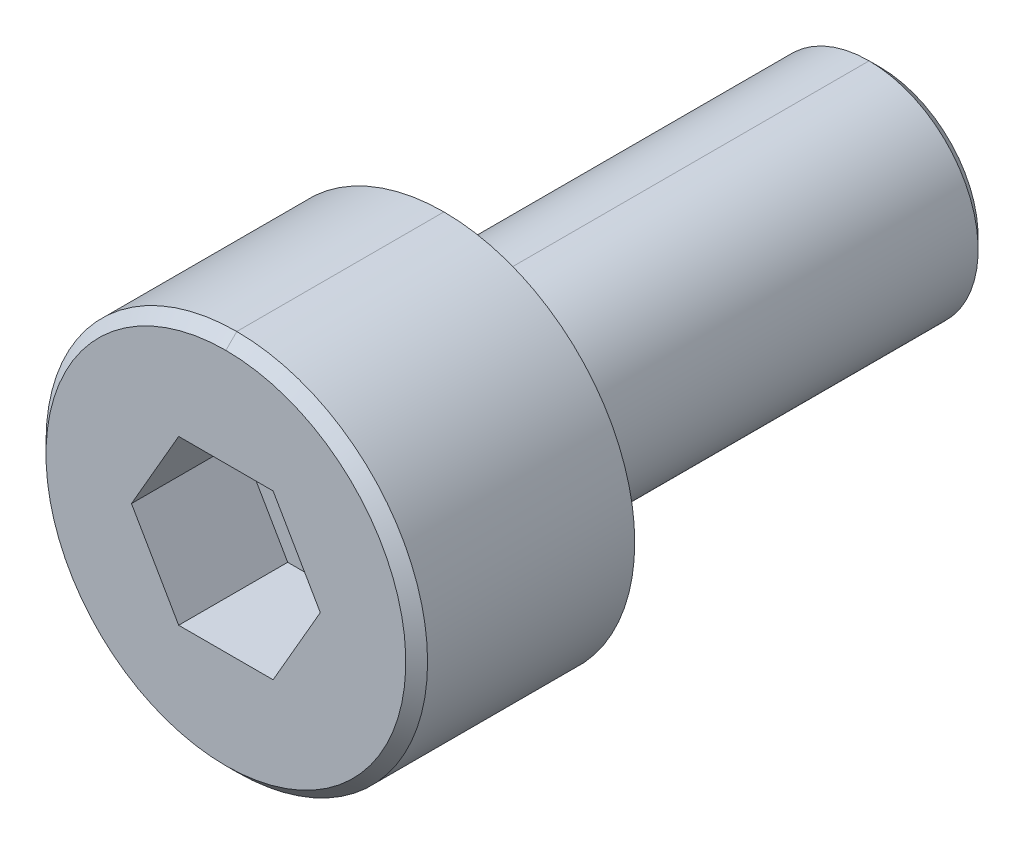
ISO-10303-21;
HEADER;
FILE_DESCRIPTION(('STEP AP214'),'2;1');
FILE_NAME('part.step','',(''),(''),'','','');
FILE_SCHEMA(('AUTOMOTIVE_DESIGN { 1 0 10303 214 1 1 1 1 }'));
ENDSEC;
DATA;
#1=APPLICATION_CONTEXT('core data for automotive mechanical design processes');
#2=APPLICATION_PROTOCOL_DEFINITION('international standard','automotive_design',2000,#1);
#3=PRODUCT_CONTEXT('',#1,'mechanical');
#4=PRODUCT('Part','Part','',(#3));
#5=PRODUCT_RELATED_PRODUCT_CATEGORY('part','',(#4));
#6=PRODUCT_DEFINITION_FORMATION('','',#4);
#7=PRODUCT_DEFINITION_CONTEXT('part definition',#1,'design');
#8=PRODUCT_DEFINITION('design','',#6,#7);
#9=PRODUCT_DEFINITION_SHAPE('','',#8);
#10=(LENGTH_UNIT() NAMED_UNIT(*) SI_UNIT(.MILLI.,.METRE.));
#11=(NAMED_UNIT(*) PLANE_ANGLE_UNIT() SI_UNIT($,.RADIAN.));
#12=(NAMED_UNIT(*) SI_UNIT($,.STERADIAN.) SOLID_ANGLE_UNIT());
#13=UNCERTAINTY_MEASURE_WITH_UNIT(LENGTH_MEASURE(1.E-05),#10,'distance_accuracy_value','');
#14=(GEOMETRIC_REPRESENTATION_CONTEXT(3) GLOBAL_UNCERTAINTY_ASSIGNED_CONTEXT((#13)) GLOBAL_UNIT_ASSIGNED_CONTEXT((#10,
#11,#12)) REPRESENTATION_CONTEXT('',''));
#15=CARTESIAN_POINT('',(0.,0.,0.));
#16=DIRECTION('',(0.,0.,1.));
#17=DIRECTION('',(1.,0.,0.));
#18=AXIS2_PLACEMENT_3D('',#15,#16,#17);
#19=CARTESIAN_POINT('',(0.,-60.262,52.8));
#20=DIRECTION('',(0.,0.,1.));
#21=DIRECTION('',(1.,0.,0.));
#22=AXIS2_PLACEMENT_3D('',#19,#20,#21);
#23=PLANE('',#22);
#24=DIRECTION('',(0.50000000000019,0.866025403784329,0.));
#25=VECTOR('',#24,1.);
#26=CARTESIAN_POINT('',(-0.866025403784,-58.762,52.8));
#27=LINE('',#26,#25);
#28=CARTESIAN_POINT('',(-1.732050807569,-60.262,52.8));
#29=VERTEX_POINT('',#28);
#30=CARTESIAN_POINT('',(-0.866025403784,-58.762,52.8));
#31=VERTEX_POINT('',#30);
#32=EDGE_CURVE('E20',#29,#31,#27,.T.);
#33=ORIENTED_EDGE('',*,*,#32,.F.);
#34=DIRECTION('',(-0.50000000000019,0.866025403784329,0.));
#35=VECTOR('',#34,1.);
#36=CARTESIAN_POINT('',(-1.732050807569,-60.262,52.8));
#37=LINE('',#36,#35);
#38=CARTESIAN_POINT('',(-0.866025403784,-61.762,52.8));
#39=VERTEX_POINT('',#38);
#40=EDGE_CURVE('E10',#39,#29,#37,.T.);
#41=ORIENTED_EDGE('',*,*,#40,.F.);
#42=DIRECTION('',(-1.,0.,0.));
#43=VECTOR('',#42,1.);
#44=CARTESIAN_POINT('',(-0.866025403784,-61.762,52.8));
#45=LINE('',#44,#43);
#46=CARTESIAN_POINT('',(0.866025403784,-61.762,52.8));
#47=VERTEX_POINT('',#46);
#48=EDGE_CURVE('E216',#47,#39,#45,.T.);
#49=ORIENTED_EDGE('',*,*,#48,.F.);
#50=DIRECTION('',(-0.50000000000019,-0.866025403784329,0.));
#51=VECTOR('',#50,1.);
#52=CARTESIAN_POINT('',(0.866025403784,-61.762,52.8));
#53=LINE('',#52,#51);
#54=CARTESIAN_POINT('',(1.732050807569,-60.262,52.8));
#55=VERTEX_POINT('',#54);
#56=EDGE_CURVE('E244',#55,#47,#53,.T.);
#57=ORIENTED_EDGE('',*,*,#56,.F.);
#58=DIRECTION('',(0.50000000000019,-0.866025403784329,0.));
#59=VECTOR('',#58,1.);
#60=CARTESIAN_POINT('',(1.732050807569,-60.262,52.8));
#61=LINE('',#60,#59);
#62=CARTESIAN_POINT('',(0.866025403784,-58.762,52.8));
#63=VERTEX_POINT('',#62);
#64=EDGE_CURVE('E129',#63,#55,#61,.T.);
#65=ORIENTED_EDGE('',*,*,#64,.F.);
#66=DIRECTION('',(1.,0.,0.));
#67=VECTOR('',#66,1.);
#68=CARTESIAN_POINT('',(0.866025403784,-58.762,52.8));
#69=LINE('',#68,#67);
#70=EDGE_CURVE('E125',#31,#63,#69,.T.);
#71=ORIENTED_EDGE('',*,*,#70,.F.);
#72=EDGE_LOOP('',(#33,#41,#49,#57,#65,#71));
#73=FACE_BOUND('',#72,.T.);
#74=ADVANCED_FACE('F16',(#73),#23,.T.);
#75=CARTESIAN_POINT('',(-1.732050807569,-60.262,52.8));
#76=DIRECTION('',(0.866025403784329,0.50000000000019,0.));
#77=DIRECTION('',(0.,0.,-1.));
#78=AXIS2_PLACEMENT_3D('',#75,#76,#77);
#79=PLANE('',#78);
#80=DIRECTION('',(-0.50000000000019,0.866025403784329,0.));
#81=VECTOR('',#80,1.);
#82=CARTESIAN_POINT('',(-1.732050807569,-60.262,54.8));
#83=LINE('',#82,#81);
#84=CARTESIAN_POINT('',(-0.866025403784,-61.762,54.8));
#85=VERTEX_POINT('',#84);
#86=CARTESIAN_POINT('',(-1.732050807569,-60.262,54.8));
#87=VERTEX_POINT('',#86);
#88=EDGE_CURVE('E151',#85,#87,#83,.T.);
#89=ORIENTED_EDGE('',*,*,#88,.F.);
#90=DIRECTION('',(0.,0.,1.));
#91=VECTOR('',#90,1.);
#92=CARTESIAN_POINT('',(-0.866025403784,-61.762,52.8));
#93=LINE('',#92,#91);
#94=EDGE_CURVE('E27',#39,#85,#93,.T.);
#95=ORIENTED_EDGE('',*,*,#94,.F.);
#96=ORIENTED_EDGE('',*,*,#40,.T.);
#97=DIRECTION('',(0.,0.,1.));
#98=VECTOR('',#97,1.);
#99=CARTESIAN_POINT('',(-1.732050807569,-60.262,52.8));
#100=LINE('',#99,#98);
#101=EDGE_CURVE('E185',#29,#87,#100,.T.);
#102=ORIENTED_EDGE('',*,*,#101,.T.);
#103=EDGE_LOOP('',(#89,#95,#96,#102));
#104=FACE_BOUND('',#103,.T.);
#105=ADVANCED_FACE('F265',(#104),#79,.T.);
#106=CARTESIAN_POINT('',(-0.866025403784,-61.762,52.8));
#107=DIRECTION('',(0.,1.,0.));
#108=DIRECTION('',(1.,0.,0.));
#109=AXIS2_PLACEMENT_3D('',#106,#107,#108);
#110=PLANE('',#109);
#111=DIRECTION('',(-1.,0.,0.));
#112=VECTOR('',#111,1.);
#113=CARTESIAN_POINT('',(-0.866025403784,-61.762,54.8));
#114=LINE('',#113,#112);
#115=CARTESIAN_POINT('',(0.866025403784,-61.762,54.8));
#116=VERTEX_POINT('',#115);
#117=EDGE_CURVE('E174',#116,#85,#114,.T.);
#118=ORIENTED_EDGE('',*,*,#117,.F.);
#119=DIRECTION('',(0.,0.,1.));
#120=VECTOR('',#119,1.);
#121=CARTESIAN_POINT('',(0.866025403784,-61.762,52.8));
#122=LINE('',#121,#120);
#123=EDGE_CURVE('E219',#47,#116,#122,.T.);
#124=ORIENTED_EDGE('',*,*,#123,.F.);
#125=ORIENTED_EDGE('',*,*,#48,.T.);
#126=ORIENTED_EDGE('',*,*,#94,.T.);
#127=EDGE_LOOP('',(#118,#124,#125,#126));
#128=FACE_BOUND('',#127,.T.);
#129=ADVANCED_FACE('F269',(#128),#110,.T.);
#130=CARTESIAN_POINT('',(0.866025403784,-61.762,52.8));
#131=DIRECTION('',(-0.866025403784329,0.50000000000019,0.));
#132=DIRECTION('',(0.,0.,1.));
#133=AXIS2_PLACEMENT_3D('',#130,#131,#132);
#134=PLANE('',#133);
#135=DIRECTION('',(-0.50000000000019,-0.866025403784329,0.));
#136=VECTOR('',#135,1.);
#137=CARTESIAN_POINT('',(0.866025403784,-61.762,54.8));
#138=LINE('',#137,#136);
#139=CARTESIAN_POINT('',(1.732050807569,-60.262,54.8));
#140=VERTEX_POINT('',#139);
#141=EDGE_CURVE('E140',#140,#116,#138,.T.);
#142=ORIENTED_EDGE('',*,*,#141,.F.);
#143=DIRECTION('',(0.,0.,1.));
#144=VECTOR('',#143,1.);
#145=CARTESIAN_POINT('',(1.732050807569,-60.262,52.8));
#146=LINE('',#145,#144);
#147=EDGE_CURVE('E135',#55,#140,#146,.T.);
#148=ORIENTED_EDGE('',*,*,#147,.F.);
#149=ORIENTED_EDGE('',*,*,#56,.T.);
#150=ORIENTED_EDGE('',*,*,#123,.T.);
#151=EDGE_LOOP('',(#142,#148,#149,#150));
#152=FACE_BOUND('',#151,.T.);
#153=ADVANCED_FACE('F275',(#152),#134,.T.);
#154=CARTESIAN_POINT('',(1.732050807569,-60.262,52.8));
#155=DIRECTION('',(-0.866025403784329,-0.50000000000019,0.));
#156=DIRECTION('',(-0.50000000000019,0.866025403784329,0.));
#157=AXIS2_PLACEMENT_3D('',#154,#155,#156);
#158=PLANE('',#157);
#159=DIRECTION('',(0.50000000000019,-0.866025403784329,0.));
#160=VECTOR('',#159,1.);
#161=CARTESIAN_POINT('',(1.732050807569,-60.262,54.8));
#162=LINE('',#161,#160);
#163=CARTESIAN_POINT('',(0.866025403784,-58.762,54.8));
#164=VERTEX_POINT('',#163);
#165=EDGE_CURVE('E132',#164,#140,#162,.T.);
#166=ORIENTED_EDGE('',*,*,#165,.F.);
#167=DIRECTION('',(0.,0.,1.));
#168=VECTOR('',#167,1.);
#169=CARTESIAN_POINT('',(0.866025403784,-58.762,52.8));
#170=LINE('',#169,#168);
#171=EDGE_CURVE('E116',#63,#164,#170,.T.);
#172=ORIENTED_EDGE('',*,*,#171,.F.);
#173=ORIENTED_EDGE('',*,*,#64,.T.);
#174=ORIENTED_EDGE('',*,*,#147,.T.);
#175=EDGE_LOOP('',(#166,#172,#173,#174));
#176=FACE_BOUND('',#175,.T.);
#177=ADVANCED_FACE('F133',(#176),#158,.T.);
#178=CARTESIAN_POINT('',(0.866025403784,-58.762,52.8));
#179=DIRECTION('',(0.,-1.,0.));
#180=DIRECTION('',(-1.,0.,0.));
#181=AXIS2_PLACEMENT_3D('',#178,#179,#180);
#182=PLANE('',#181);
#183=DIRECTION('',(1.,0.,0.));
#184=VECTOR('',#183,1.);
#185=CARTESIAN_POINT('',(0.866025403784,-58.762,54.8));
#186=LINE('',#185,#184);
#187=CARTESIAN_POINT('',(-0.866025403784,-58.762,54.8));
#188=VERTEX_POINT('',#187);
#189=EDGE_CURVE('E121',#188,#164,#186,.T.);
#190=ORIENTED_EDGE('',*,*,#189,.F.);
#191=DIRECTION('',(0.,0.,1.));
#192=VECTOR('',#191,1.);
#193=CARTESIAN_POINT('',(-0.866025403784,-58.762,52.8));
#194=LINE('',#193,#192);
#195=EDGE_CURVE('E245',#31,#188,#194,.T.);
#196=ORIENTED_EDGE('',*,*,#195,.F.);
#197=ORIENTED_EDGE('',*,*,#70,.T.);
#198=ORIENTED_EDGE('',*,*,#171,.T.);
#199=EDGE_LOOP('',(#190,#196,#197,#198));
#200=FACE_BOUND('',#199,.T.);
#201=ADVANCED_FACE('F118',(#200),#182,.T.);
#202=CARTESIAN_POINT('',(-0.866025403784,-58.762,52.8));
#203=DIRECTION('',(0.866025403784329,-0.50000000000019,0.));
#204=DIRECTION('',(0.,0.,-1.));
#205=AXIS2_PLACEMENT_3D('',#202,#203,#204);
#206=PLANE('',#205);
#207=DIRECTION('',(0.50000000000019,0.866025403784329,0.));
#208=VECTOR('',#207,1.);
#209=CARTESIAN_POINT('',(-0.866025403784,-58.762,54.8));
#210=LINE('',#209,#208);
#211=EDGE_CURVE('E145',#87,#188,#210,.T.);
#212=ORIENTED_EDGE('',*,*,#211,.F.);
#213=ORIENTED_EDGE('',*,*,#101,.F.);
#214=ORIENTED_EDGE('',*,*,#32,.T.);
#215=ORIENTED_EDGE('',*,*,#195,.T.);
#216=EDGE_LOOP('',(#212,#213,#214,#215));
#217=FACE_BOUND('',#216,.T.);
#218=ADVANCED_FACE('F257',(#217),#206,.T.);
#219=CARTESIAN_POINT('',(-1.8,-60.262,42.8));
#220=DIRECTION('',(0.,0.,-1.));
#221=DIRECTION('',(-1.,0.,0.));
#222=AXIS2_PLACEMENT_3D('',#219,#220,#221);
#223=PLANE('',#222);
#224=CARTESIAN_POINT('',(0.,-60.262,42.8));
#225=DIRECTION('',(0.,0.,1.));
#226=DIRECTION('',(0.,1.,0.));
#227=AXIS2_PLACEMENT_3D('',#224,#225,#226);
#228=CIRCLE('',#227,1.8);
#229=CARTESIAN_POINT('',(0.,-58.462,42.8));
#230=VERTEX_POINT('',#229);
#231=CARTESIAN_POINT('',(0.,-62.062,42.8));
#232=VERTEX_POINT('',#231);
#233=EDGE_CURVE('E169',#230,#232,#228,.T.);
#234=ORIENTED_EDGE('',*,*,#233,.F.);
#235=CARTESIAN_POINT('',(0.,-60.262,42.8));
#236=DIRECTION('',(0.,0.,1.));
#237=DIRECTION('',(0.,1.,0.));
#238=AXIS2_PLACEMENT_3D('',#235,#236,#237);
#239=CIRCLE('',#238,1.8);
#240=EDGE_CURVE('E189',#232,#230,#239,.T.);
#241=ORIENTED_EDGE('',*,*,#240,.F.);
#242=EDGE_LOOP('',(#234,#241));
#243=FACE_BOUND('',#242,.T.);
#244=ADVANCED_FACE('F295',(#243),#223,.T.);
#245=CARTESIAN_POINT('',(0.,-60.262,43.));
#246=DIRECTION('',(0.,0.,1.));
#247=DIRECTION('',(0.,1.,0.));
#248=AXIS2_PLACEMENT_3D('',#245,#246,#247);
#249=CONICAL_SURFACE('',#248,2.,0.785398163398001);
#250=DIRECTION('',(0.,-0.707106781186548,0.707106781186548));
#251=VECTOR('',#250,1.);
#252=CARTESIAN_POINT('',(0.,-62.262,43.));
#253=LINE('',#252,#251);
#254=CARTESIAN_POINT('',(0.,-62.262,43.));
#255=VERTEX_POINT('',#254);
#256=EDGE_CURVE('E173',#232,#255,#253,.T.);
#257=ORIENTED_EDGE('',*,*,#256,.F.);
#258=ORIENTED_EDGE('',*,*,#240,.T.);
#259=DIRECTION('',(0.,0.707106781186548,0.707106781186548));
#260=VECTOR('',#259,1.);
#261=CARTESIAN_POINT('',(0.,-58.262,43.));
#262=LINE('',#261,#260);
#263=CARTESIAN_POINT('',(0.,-58.262,43.));
#264=VERTEX_POINT('',#263);
#265=EDGE_CURVE('E193',#230,#264,#262,.T.);
#266=ORIENTED_EDGE('',*,*,#265,.T.);
#267=CARTESIAN_POINT('',(0.,-60.262,43.));
#268=DIRECTION('',(0.,0.,1.));
#269=DIRECTION('',(0.,1.,0.));
#270=AXIS2_PLACEMENT_3D('',#267,#268,#269);
#271=CIRCLE('',#270,2.);
#272=EDGE_CURVE('E206',#255,#264,#271,.T.);
#273=ORIENTED_EDGE('',*,*,#272,.F.);
#274=EDGE_LOOP('',(#257,#258,#266,#273));
#275=FACE_BOUND('',#274,.T.);
#276=ADVANCED_FACE('F18',(#275),#249,.T.);
#277=CARTESIAN_POINT('',(0.,-60.262,550.8));
#278=DIRECTION('',(0.,0.,1.));
#279=DIRECTION('',(0.,1.,0.));
#280=AXIS2_PLACEMENT_3D('',#277,#278,#279);
#281=CYLINDRICAL_SURFACE('',#280,2.);
#282=DIRECTION('',(0.,0.,1.));
#283=VECTOR('',#282,1.);
#284=CARTESIAN_POINT('',(0.,-62.262,550.8));
#285=LINE('',#284,#283);
#286=CARTESIAN_POINT('',(0.,-62.262,50.8));
#287=VERTEX_POINT('',#286);
#288=EDGE_CURVE('E165',#255,#287,#285,.T.);
#289=ORIENTED_EDGE('',*,*,#288,.F.);
#290=ORIENTED_EDGE('',*,*,#272,.T.);
#291=DIRECTION('',(0.,0.,1.));
#292=VECTOR('',#291,1.);
#293=CARTESIAN_POINT('',(0.,-58.262,550.8));
#294=LINE('',#293,#292);
#295=CARTESIAN_POINT('',(0.,-58.262,50.8));
#296=VERTEX_POINT('',#295);
#297=EDGE_CURVE('E164',#264,#296,#294,.T.);
#298=ORIENTED_EDGE('',*,*,#297,.T.);
#299=CARTESIAN_POINT('',(0.,-60.262,50.8));
#300=DIRECTION('',(0.,0.,1.));
#301=DIRECTION('',(0.,1.,0.));
#302=AXIS2_PLACEMENT_3D('',#299,#300,#301);
#303=CIRCLE('',#302,2.);
#304=EDGE_CURVE('E203',#287,#296,#303,.T.);
#305=ORIENTED_EDGE('',*,*,#304,.F.);
#306=EDGE_LOOP('',(#289,#290,#298,#305));
#307=FACE_BOUND('',#306,.T.);
#308=ADVANCED_FACE('F294',(#307),#281,.T.);
#309=CARTESIAN_POINT('',(-3.5,-60.262,50.8));
#310=DIRECTION('',(0.,0.,-1.));
#311=DIRECTION('',(-1.,0.,0.));
#312=AXIS2_PLACEMENT_3D('',#309,#310,#311);
#313=PLANE('',#312);
#314=CARTESIAN_POINT('',(0.,-60.262,50.8));
#315=DIRECTION('',(0.,0.,1.));
#316=DIRECTION('',(0.,1.,0.));
#317=AXIS2_PLACEMENT_3D('',#314,#315,#316);
#318=CIRCLE('',#317,3.5);
#319=CARTESIAN_POINT('',(0.,-56.762,50.8));
#320=VERTEX_POINT('',#319);
#321=CARTESIAN_POINT('',(0.,-63.762,50.8));
#322=VERTEX_POINT('',#321);
#323=EDGE_CURVE('E239',#320,#322,#318,.T.);
#324=ORIENTED_EDGE('',*,*,#323,.F.);
#325=CARTESIAN_POINT('',(0.,-60.262,50.8));
#326=DIRECTION('',(0.,0.,1.));
#327=DIRECTION('',(0.,1.,0.));
#328=AXIS2_PLACEMENT_3D('',#325,#326,#327);
#329=CIRCLE('',#328,3.5);
#330=EDGE_CURVE('E198',#322,#320,#329,.T.);
#331=ORIENTED_EDGE('',*,*,#330,.F.);
#332=EDGE_LOOP('',(#324,#331));
#333=FACE_BOUND('',#332,.T.);
#334=CARTESIAN_POINT('',(0.,-60.262,50.8));
#335=DIRECTION('',(0.,0.,1.));
#336=DIRECTION('',(0.,1.,0.));
#337=AXIS2_PLACEMENT_3D('',#334,#335,#336);
#338=CIRCLE('',#337,2.);
#339=EDGE_CURVE('E160',#296,#287,#338,.T.);
#340=ORIENTED_EDGE('',*,*,#339,.T.);
#341=ORIENTED_EDGE('',*,*,#304,.T.);
#342=EDGE_LOOP('',(#340,#341));
#343=FACE_BOUND('',#342,.T.);
#344=ADVANCED_FACE('F309',(#333,#343),#313,.T.);
#345=CARTESIAN_POINT('',(0.,-60.262,550.8));
#346=DIRECTION('',(0.,0.,1.));
#347=DIRECTION('',(0.,1.,0.));
#348=AXIS2_PLACEMENT_3D('',#345,#346,#347);
#349=CYLINDRICAL_SURFACE('',#348,3.5);
#350=DIRECTION('',(0.,0.,1.));
#351=VECTOR('',#350,1.);
#352=CARTESIAN_POINT('',(0.,-63.762,550.8));
#353=LINE('',#352,#351);
#354=CARTESIAN_POINT('',(0.,-63.762,54.6));
#355=VERTEX_POINT('',#354);
#356=EDGE_CURVE('E184',#322,#355,#353,.T.);
#357=ORIENTED_EDGE('',*,*,#356,.F.);
#358=ORIENTED_EDGE('',*,*,#330,.T.);
#359=DIRECTION('',(0.,0.,1.));
#360=VECTOR('',#359,1.);
#361=CARTESIAN_POINT('',(0.,-56.762,550.8));
#362=LINE('',#361,#360);
#363=CARTESIAN_POINT('',(0.,-56.762,54.6));
#364=VERTEX_POINT('',#363);
#365=EDGE_CURVE('E183',#320,#364,#362,.T.);
#366=ORIENTED_EDGE('',*,*,#365,.T.);
#367=CARTESIAN_POINT('',(0.,-60.262,54.6));
#368=DIRECTION('',(0.,0.,1.));
#369=DIRECTION('',(0.,1.,0.));
#370=AXIS2_PLACEMENT_3D('',#367,#368,#369);
#371=CIRCLE('',#370,3.5);
#372=EDGE_CURVE('E177',#355,#364,#371,.T.);
#373=ORIENTED_EDGE('',*,*,#372,.F.);
#374=EDGE_LOOP('',(#357,#358,#366,#373));
#375=FACE_BOUND('',#374,.T.);
#376=ADVANCED_FACE('F303',(#375),#349,.T.);
#377=CARTESIAN_POINT('',(0.,-60.262,54.8));
#378=DIRECTION('',(0.,0.,-1.));
#379=DIRECTION('',(0.,-1.,0.));
#380=AXIS2_PLACEMENT_3D('',#377,#378,#379);
#381=CONICAL_SURFACE('',#380,3.3,0.785398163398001);
#382=DIRECTION('',(0.,0.707106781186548,-0.707106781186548));
#383=VECTOR('',#382,1.);
#384=CARTESIAN_POINT('',(0.,-56.962,54.8));
#385=LINE('',#384,#383);
#386=CARTESIAN_POINT('',(0.,-56.962,54.8));
#387=VERTEX_POINT('',#386);
#388=EDGE_CURVE('E155',#387,#364,#385,.T.);
#389=ORIENTED_EDGE('',*,*,#388,.F.);
#390=CARTESIAN_POINT('',(0.,-60.262,54.8));
#391=DIRECTION('',(0.,0.,1.));
#392=DIRECTION('',(0.,1.,0.));
#393=AXIS2_PLACEMENT_3D('',#390,#391,#392);
#394=CIRCLE('',#393,3.3);
#395=CARTESIAN_POINT('',(0.,-63.562,54.8));
#396=VERTEX_POINT('',#395);
#397=EDGE_CURVE('E166',#396,#387,#394,.T.);
#398=ORIENTED_EDGE('',*,*,#397,.F.);
#399=DIRECTION('',(0.,-0.707106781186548,-0.707106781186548));
#400=VECTOR('',#399,1.);
#401=CARTESIAN_POINT('',(0.,-63.562,54.8));
#402=LINE('',#401,#400);
#403=EDGE_CURVE('E158',#396,#355,#402,.T.);
#404=ORIENTED_EDGE('',*,*,#403,.T.);
#405=ORIENTED_EDGE('',*,*,#372,.T.);
#406=EDGE_LOOP('',(#389,#398,#404,#405));
#407=FACE_BOUND('',#406,.T.);
#408=ADVANCED_FACE('F308',(#407),#381,.T.);
#409=CARTESIAN_POINT('',(0.,-60.262,54.8));
#410=DIRECTION('',(0.,0.,1.));
#411=DIRECTION('',(1.,0.,0.));
#412=AXIS2_PLACEMENT_3D('',#409,#410,#411);
#413=PLANE('',#412);
#414=ORIENTED_EDGE('',*,*,#88,.T.);
#415=ORIENTED_EDGE('',*,*,#211,.T.);
#416=ORIENTED_EDGE('',*,*,#189,.T.);
#417=ORIENTED_EDGE('',*,*,#165,.T.);
#418=ORIENTED_EDGE('',*,*,#141,.T.);
#419=ORIENTED_EDGE('',*,*,#117,.T.);
#420=EDGE_LOOP('',(#414,#415,#416,#417,#418,#419));
#421=FACE_BOUND('',#420,.T.);
#422=ORIENTED_EDGE('',*,*,#397,.T.);
#423=CARTESIAN_POINT('',(0.,-60.262,54.8));
#424=DIRECTION('',(0.,0.,1.));
#425=DIRECTION('',(0.,1.,0.));
#426=AXIS2_PLACEMENT_3D('',#423,#424,#425);
#427=CIRCLE('',#426,3.3);
#428=EDGE_CURVE('E159',#387,#396,#427,.T.);
#429=ORIENTED_EDGE('',*,*,#428,.T.);
#430=EDGE_LOOP('',(#422,#429));
#431=FACE_BOUND('',#430,.T.);
#432=ADVANCED_FACE('F142',(#421,#431),#413,.T.);
#433=CARTESIAN_POINT('',(0.,-60.262,54.8));
#434=DIRECTION('',(0.,0.,-1.));
#435=DIRECTION('',(0.,-1.,0.));
#436=AXIS2_PLACEMENT_3D('',#433,#434,#435);
#437=CONICAL_SURFACE('',#436,3.3,0.785398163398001);
#438=ORIENTED_EDGE('',*,*,#428,.F.);
#439=ORIENTED_EDGE('',*,*,#388,.T.);
#440=CARTESIAN_POINT('',(0.,-60.262,54.6));
#441=DIRECTION('',(0.,0.,1.));
#442=DIRECTION('',(0.,1.,0.));
#443=AXIS2_PLACEMENT_3D('',#440,#441,#442);
#444=CIRCLE('',#443,3.5);
#445=EDGE_CURVE('E179',#364,#355,#444,.T.);
#446=ORIENTED_EDGE('',*,*,#445,.T.);
#447=ORIENTED_EDGE('',*,*,#403,.F.);
#448=EDGE_LOOP('',(#438,#439,#446,#447));
#449=FACE_BOUND('',#448,.T.);
#450=ADVANCED_FACE('F377',(#449),#437,.T.);
#451=CARTESIAN_POINT('',(0.,-60.262,550.8));
#452=DIRECTION('',(0.,0.,1.));
#453=DIRECTION('',(0.,1.,0.));
#454=AXIS2_PLACEMENT_3D('',#451,#452,#453);
#455=CYLINDRICAL_SURFACE('',#454,3.5);
#456=ORIENTED_EDGE('',*,*,#323,.T.);
#457=ORIENTED_EDGE('',*,*,#356,.T.);
#458=ORIENTED_EDGE('',*,*,#445,.F.);
#459=ORIENTED_EDGE('',*,*,#365,.F.);
#460=EDGE_LOOP('',(#456,#457,#458,#459));
#461=FACE_BOUND('',#460,.T.);
#462=ADVANCED_FACE('F372',(#461),#455,.T.);
#463=CARTESIAN_POINT('',(0.,-60.262,550.8));
#464=DIRECTION('',(0.,0.,1.));
#465=DIRECTION('',(0.,1.,0.));
#466=AXIS2_PLACEMENT_3D('',#463,#464,#465);
#467=CYLINDRICAL_SURFACE('',#466,2.);
#468=CARTESIAN_POINT('',(0.,-60.262,43.));
#469=DIRECTION('',(0.,0.,1.));
#470=DIRECTION('',(0.,1.,0.));
#471=AXIS2_PLACEMENT_3D('',#468,#469,#470);
#472=CIRCLE('',#471,2.);
#473=EDGE_CURVE('E202',#264,#255,#472,.T.);
#474=ORIENTED_EDGE('',*,*,#473,.T.);
#475=ORIENTED_EDGE('',*,*,#288,.T.);
#476=ORIENTED_EDGE('',*,*,#339,.F.);
#477=ORIENTED_EDGE('',*,*,#297,.F.);
#478=EDGE_LOOP('',(#474,#475,#476,#477));
#479=FACE_BOUND('',#478,.T.);
#480=ADVANCED_FACE('F347',(#479),#467,.T.);
#481=CARTESIAN_POINT('',(0.,-60.262,43.));
#482=DIRECTION('',(0.,0.,1.));
#483=DIRECTION('',(0.,1.,0.));
#484=AXIS2_PLACEMENT_3D('',#481,#482,#483);
#485=CONICAL_SURFACE('',#484,2.,0.785398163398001);
#486=ORIENTED_EDGE('',*,*,#233,.T.);
#487=ORIENTED_EDGE('',*,*,#256,.T.);
#488=ORIENTED_EDGE('',*,*,#473,.F.);
#489=ORIENTED_EDGE('',*,*,#265,.F.);
#490=EDGE_LOOP('',(#486,#487,#488,#489));
#491=FACE_BOUND('',#490,.T.);
#492=ADVANCED_FACE('F342',(#491),#485,.T.);
#493=CLOSED_SHELL('',(#74,#105,#129,#153,#177,#201,#218,#244,#276,#308,#344,#376,#408,#432,#450,
#462,#480,#492));
#494=MANIFOLD_SOLID_BREP('B1',#493);
#495=ADVANCED_BREP_SHAPE_REPRESENTATION('',(#18,#494),#14);
#496=SHAPE_DEFINITION_REPRESENTATION(#9,#495);
ENDSEC;
END-ISO-10303-21;
